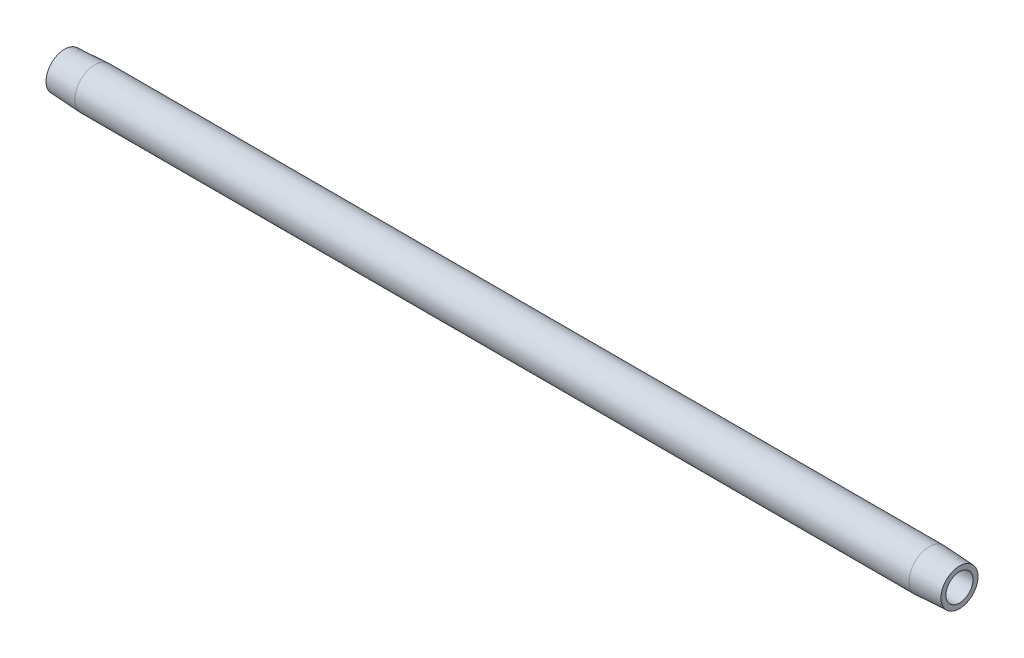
from build123d import *


with BuildPart() as part:
    # Sketch1 → Revolve1 (revolve)
    with BuildSketch(Plane(origin=(0, 0, 0), x_dir=(1, 0, 0), z_dir=(0, 1, 0)), mode=Mode.PRIVATE) as revolve1_sk:
        Polygon((304.8, 4.622776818), (0, 4.622776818), (0, 6.317526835), (10.3124, 6.857976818), (294.4876, 6.857976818), (304.8, 6.317526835), align=None)
    revolve(revolve1_sk.sketch.rotate(Axis((-6.375994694, 0, 0), (1, 0, 0)), 180), axis=Axis((-6.375994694, 0, 0), (1, 0, 0)))


solid = part.part
